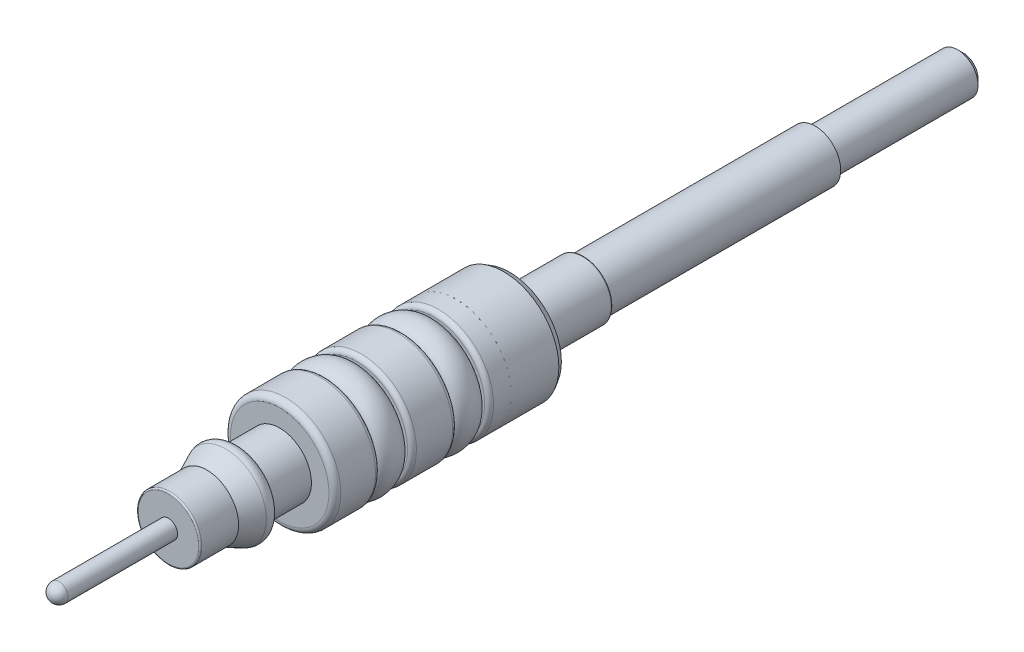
from build123d import *

# Parameters (mm, degrees)
SKETCH3_W          = 19.812
SKETCH3_H          = 0.4318
SKETCH5_R          = 0.7874
CUT_EXTRUDE2_DEPTH = 9.525
CHAMFER1_SIZE      = 0.508
FILLET1_R          = 0.508
FILLET2_R          = 0.381
FILLET3_R          = 0.508
FILLET4_R          = 0.127
SKETCH8_W          = 0.0254
SKETCH8_H          = 1.5494
SKETCH9_RX         = 1.218307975
SKETCH9_RY         = 0.690980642


with BuildPart() as part:
    # Sketch1 → Revolve1 (revolve)
    with BuildSketch(Plane(origin=(0, 0, 0), x_dir=(0, 0, -1), z_dir=(1, 0, 0)), mode=Mode.PRIVATE) as revolve1_sk:
        with BuildLine():
            Line((0, 0), (0, 2.7178))
            Line((0, 2.7178), (3.293178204, 2.7178))
            Line((3.293178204, 2.7178), (4.910364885, 3.471906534))
            ThreePointArc((4.910364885, 3.471906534), (5.641822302, 3.423964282), (5.9944, 2.7813))
            Line((5.9944, 2.7813), (5.9944, 2.7178))
            Line((5.9944, 2.7178), (9.525, 2.7178))
            Line((9.525, 2.7178), (9.525, 0))
            Line((9.525, 0), (0, 0))
        make_face()
    revolve(revolve1_sk.sketch.rotate(Axis((0, 0, 84.123695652), (0, 0, -1)), 90), axis=Axis((0, 0, 84.123695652), (0, 0, -1)))

    # Sketch2 → Revolve2 (revolve)
    with BuildSketch(Plane(origin=(0, 0, 0), x_dir=(0, 0, -1), z_dir=(1, 0, 0)), mode=Mode.PRIVATE) as revolve2_sk:
        Polygon((9.525, 0), (9.525, 4.7244), (13.3858, 4.7244), (13.3858, 3.3782), (16.129, 3.3782), (16.129, 4.7244), (19.9898, 4.7244), (19.9898, 3.3782), (22.733, 3.3782), (22.733, 4.7244), (28.702, 4.7244), (29.21, 4.431106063), (29.21, 2.4765), (35.56, 2.4765), (35.56, 1.7526), (41.91, 1.7526), (41.91, 1.3335), (35.56, 1.3335), (35.56, 0), align=None)
    revolve(revolve2_sk.sketch.rotate(Axis((0, 0, 21.608170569), (0, 0, -1)), 90), axis=Axis((0, 0, 21.608170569), (0, 0, -1)))

    # Sketch5 → Cut-Extrude2 (cut)
    with BuildSketch(Plane.XY):
        Circle(SKETCH5_R)
    extrude(amount=-CUT_EXTRUDE2_DEPTH, mode=Mode.SUBTRACT)

    # Fillet1
    fillet1_edges = [part.edges().sort_by_distance(p)[0] for p in [
        (-4.7244, 0, -9.525),
    ]]
    fillet(fillet1_edges, radius=FILLET1_R)

    # Fillet2
    fillet2_edges = [part.edges().sort_by_distance(p)[0] for p in [
        (-4.7244, 0, -13.3858),
        (-4.7244, 0, -16.129),
        (-4.7244, 0, -19.9898),
        (-4.7244, 0, -22.733),
    ]]
    fillet(fillet2_edges, radius=FILLET2_R)

    # Fillet3
    fillet3_edges = [part.edges().sort_by_distance(p)[0] for p in [
        (-3.3782, 0, -13.3858),
        (-3.3782, 0, -16.129),
        (-3.3782, 0, -19.9898),
        (-3.3782, 0, -22.733),
    ]]
    fillet(fillet3_edges, radius=FILLET3_R)

    # Fillet4
    fillet4_edges = [part.edges().sort_by_distance(p)[0] for p in [
        (-2.4765, 0, -35.56),
        (-2.7178, 0, 0),
    ]]
    fillet(fillet4_edges, radius=FILLET4_R)


with BuildPart() as body_2:
    # Sketch3 → Revolve3 (revolve)
    with BuildSketch(Plane(origin=(0, 0, 0), x_dir=(0, 0, -1), z_dir=(1, 0, 0)), mode=Mode.PRIVATE) as revolve3_sk:
        with Locations((45.466, 1.9685)):
            Rectangle(SKETCH3_W, SKETCH3_H)
    revolve(revolve3_sk.sketch.rotate(Axis((0, 0, 2.800507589), (0, 0, -1)), 90), axis=Axis((0, 0, 2.800507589), (0, 0, -1)))


with BuildPart() as body_3:
    # Sketch6 → Revolve4 (revolve)
    with BuildSketch(Plane(origin=(0, 0, 0), x_dir=(0, 0, -1), z_dir=(1, 0, 0)), mode=Mode.PRIVATE) as revolve4_sk:
        Polygon((68.072, 1.74625), (41.91, 1.74625), (41.91, 1.3335), (35.56, 1.3335), (35.56, 0), (68.072, 0), align=None)
    revolve(revolve4_sk.sketch.rotate(Axis((0, 0, 6.762811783), (0, 0, -1)), 90), axis=Axis((0, 0, 6.762811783), (0, 0, -1)))

    # Chamfer1
    chamfer1_edges = [body_3.edges().sort_by_distance(p)[0] for p in [
        (-1.74625, 0, -68.072),
    ]]
    chamfer(chamfer1_edges, length=CHAMFER1_SIZE)


with BuildPart() as body_4:
    # Sketch7 → Revolve5 (revolve)
    with BuildSketch(Plane(origin=(0, 0, 0), x_dir=(0, 0, -1), z_dir=(1, 0, 0)), mode=Mode.PRIVATE) as revolve5_sk:
        with BuildLine():
            Line((9.525, 0.7874), (-9.3726, 0.7874))
            ThreePointArc((-9.3726, 0.7874), (-9.92937588, 0.55677588), (-10.16, 0))
            Line((-10.16, 0), (9.525, 0))
            Line((9.525, 0), (9.525, 0.7874))
        make_face()
    revolve(revolve5_sk.sketch.rotate(Axis((0, 0, -7.238778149), (0, 0, 1)), 90), axis=Axis((0, 0, -7.238778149), (0, 0, 1)))


with BuildPart() as body_5:
    # Sketch8 → Revolve6 (revolve)
    with BuildSketch(Plane(origin=(0, 0, 0), x_dir=(0, 0, -1), z_dir=(1, 0, 0)), mode=Mode.PRIVATE) as revolve6_sk:
        with Locations((24.6253, 3.9497)):
            Rectangle(SKETCH8_W, SKETCH8_H)
    revolve(revolve6_sk.sketch.rotate(Axis((0, 0, 0), (0, 0, -1)), 270), axis=Axis((0, 0, 0), (0, 0, -1)))


with BuildPart() as body_6:
    # Sketch9 → Revolve7 (revolve)
    with BuildSketch(Plane(origin=(0, 0, 0), x_dir=(0, 0, -1), z_dir=(1, 0, 0)), mode=Mode.PRIVATE) as revolve7_sk:
        with Locations((14.792412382, 4.069180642)):
            Ellipse(SKETCH9_RX, SKETCH9_RY)
        with Locations((21.396412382, 4.069180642)):
            Ellipse(SKETCH9_RX, SKETCH9_RY)
    revolve(revolve7_sk.sketch.rotate(Axis((0, 0, -50.124914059), (0, 0, 1)), 90), axis=Axis((0, 0, -50.124914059), (0, 0, 1)))


solid = Compound([part.part, body_2.part, body_3.part, body_4.part, body_5.part, body_6.part])
